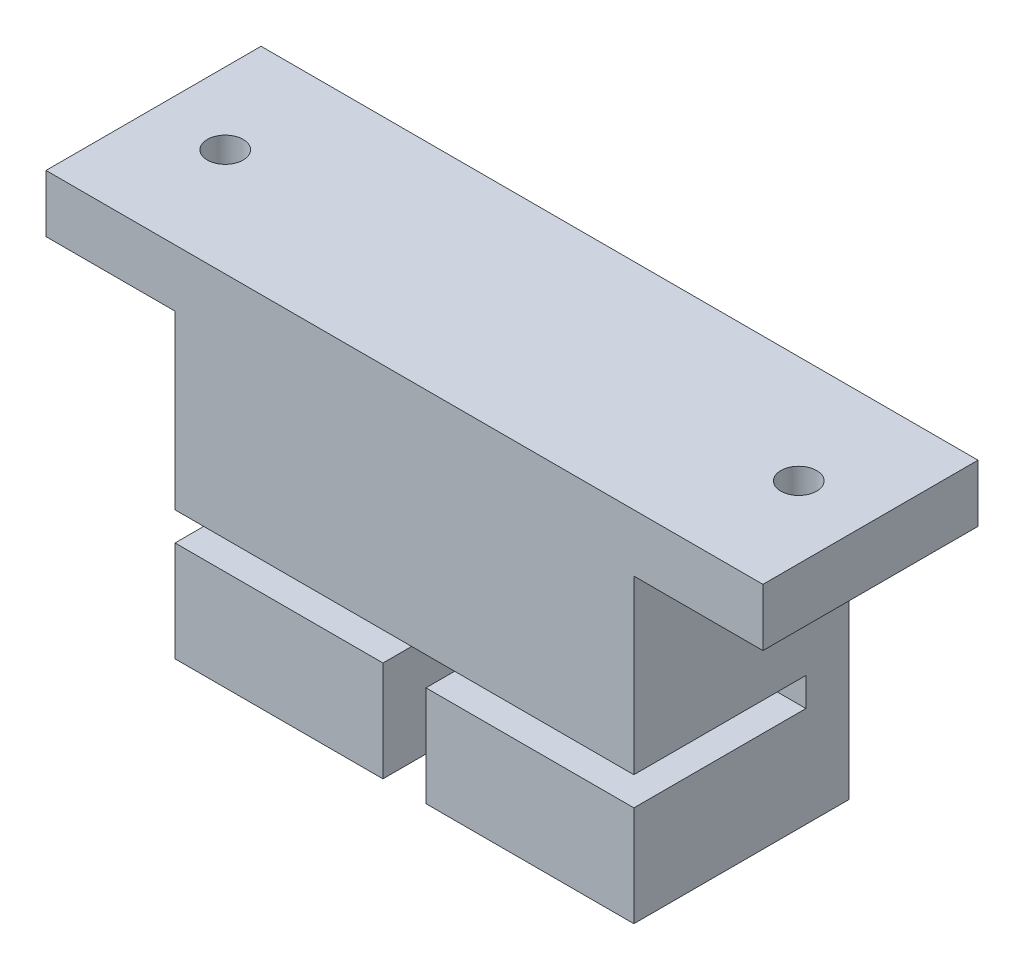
ISO-10303-21;
HEADER;
FILE_DESCRIPTION(('STEP AP214'),'2;1');
FILE_NAME('part.step','',(''),(''),'','','');
FILE_SCHEMA(('AUTOMOTIVE_DESIGN { 1 0 10303 214 1 1 1 1 }'));
ENDSEC;
DATA;
#1=APPLICATION_CONTEXT('core data for automotive mechanical design processes');
#2=APPLICATION_PROTOCOL_DEFINITION('international standard','automotive_design',2000,#1);
#3=PRODUCT_CONTEXT('',#1,'mechanical');
#4=PRODUCT('Part','Part','',(#3));
#5=PRODUCT_RELATED_PRODUCT_CATEGORY('part','',(#4));
#6=PRODUCT_DEFINITION_FORMATION('','',#4);
#7=PRODUCT_DEFINITION_CONTEXT('part definition',#1,'design');
#8=PRODUCT_DEFINITION('design','',#6,#7);
#9=PRODUCT_DEFINITION_SHAPE('','',#8);
#10=(LENGTH_UNIT() NAMED_UNIT(*) SI_UNIT(.MILLI.,.METRE.));
#11=(NAMED_UNIT(*) PLANE_ANGLE_UNIT() SI_UNIT($,.RADIAN.));
#12=(NAMED_UNIT(*) SI_UNIT($,.STERADIAN.) SOLID_ANGLE_UNIT());
#13=UNCERTAINTY_MEASURE_WITH_UNIT(LENGTH_MEASURE(1.E-05),#10,'distance_accuracy_value','');
#14=(GEOMETRIC_REPRESENTATION_CONTEXT(3) GLOBAL_UNCERTAINTY_ASSIGNED_CONTEXT((#13)) GLOBAL_UNIT_ASSIGNED_CONTEXT((#10,
#11,#12)) REPRESENTATION_CONTEXT('',''));
#15=CARTESIAN_POINT('',(0.,0.,0.));
#16=DIRECTION('',(0.,0.,1.));
#17=DIRECTION('',(1.,0.,0.));
#18=AXIS2_PLACEMENT_3D('',#15,#16,#17);
#19=CARTESIAN_POINT('',(0.,0.,15.));
#20=DIRECTION('',(0.,0.,1.));
#21=DIRECTION('',(1.,0.,0.));
#22=AXIS2_PLACEMENT_3D('',#19,#20,#21);
#23=PLANE('',#22);
#24=DIRECTION('',(0.,-1.,0.));
#25=VECTOR('',#24,1.);
#26=CARTESIAN_POINT('',(-1.5,-10.5,15.));
#27=LINE('',#26,#25);
#28=CARTESIAN_POINT('',(-1.5,-3.5,15.));
#29=VERTEX_POINT('',#28);
#30=CARTESIAN_POINT('',(-1.5,-10.5,15.));
#31=VERTEX_POINT('',#30);
#32=EDGE_CURVE('E250',#29,#31,#27,.T.);
#33=ORIENTED_EDGE('',*,*,#32,.F.);
#34=DIRECTION('',(1.,0.,0.));
#35=VECTOR('',#34,1.);
#36=CARTESIAN_POINT('',(-16.,-3.5,15.));
#37=LINE('',#36,#35);
#38=CARTESIAN_POINT('',(-16.,-3.5,15.));
#39=VERTEX_POINT('',#38);
#40=EDGE_CURVE('E238',#39,#29,#37,.T.);
#41=ORIENTED_EDGE('',*,*,#40,.F.);
#42=DIRECTION('',(0.,-1.,0.));
#43=VECTOR('',#42,1.);
#44=CARTESIAN_POINT('',(-16.,10.5,15.));
#45=LINE('',#44,#43);
#46=CARTESIAN_POINT('',(-16.,-10.5,15.));
#47=VERTEX_POINT('',#46);
#48=EDGE_CURVE('E140',#39,#47,#45,.T.);
#49=ORIENTED_EDGE('',*,*,#48,.T.);
#50=DIRECTION('',(1.,0.,0.));
#51=VECTOR('',#50,1.);
#52=CARTESIAN_POINT('',(-16.,-10.5,15.));
#53=LINE('',#52,#51);
#54=EDGE_CURVE('E159',#47,#31,#53,.T.);
#55=ORIENTED_EDGE('',*,*,#54,.T.);
#56=EDGE_LOOP('',(#33,#41,#49,#55));
#57=FACE_BOUND('',#56,.T.);
#58=ADVANCED_FACE('F44',(#57),#23,.T.);
#59=DIRECTION('',(-1.,0.,0.));
#60=VECTOR('',#59,1.);
#61=CARTESIAN_POINT('',(-16.,-1.5,15.));
#62=LINE('',#61,#60);
#63=CARTESIAN_POINT('',(16.,-1.5,15.));
#64=VERTEX_POINT('',#63);
#65=CARTESIAN_POINT('',(-16.,-1.5,15.));
#66=VERTEX_POINT('',#65);
#67=EDGE_CURVE('E242',#64,#66,#62,.T.);
#68=ORIENTED_EDGE('',*,*,#67,.F.);
#69=DIRECTION('',(0.,1.,0.));
#70=VECTOR('',#69,1.);
#71=CARTESIAN_POINT('',(16.,10.5,15.));
#72=LINE('',#71,#70);
#73=CARTESIAN_POINT('',(16.,10.5,15.));
#74=VERTEX_POINT('',#73);
#75=EDGE_CURVE('E111',#64,#74,#72,.T.);
#76=ORIENTED_EDGE('',*,*,#75,.T.);
#77=DIRECTION('',(1.,0.,0.));
#78=VECTOR('',#77,1.);
#79=CARTESIAN_POINT('',(16.,10.5,15.));
#80=LINE('',#79,#78);
#81=CARTESIAN_POINT('',(25.,10.5,15.));
#82=VERTEX_POINT('',#81);
#83=EDGE_CURVE('E214',#74,#82,#80,.T.);
#84=ORIENTED_EDGE('',*,*,#83,.T.);
#85=DIRECTION('',(0.,1.,0.));
#86=VECTOR('',#85,1.);
#87=CARTESIAN_POINT('',(25.,10.5,15.));
#88=LINE('',#87,#86);
#89=CARTESIAN_POINT('',(25.,14.5,15.));
#90=VERTEX_POINT('',#89);
#91=EDGE_CURVE('E197',#82,#90,#88,.T.);
#92=ORIENTED_EDGE('',*,*,#91,.T.);
#93=DIRECTION('',(-1.,0.,0.));
#94=VECTOR('',#93,1.);
#95=CARTESIAN_POINT('',(-25.,14.5,15.));
#96=LINE('',#95,#94);
#97=CARTESIAN_POINT('',(-25.,14.5,15.));
#98=VERTEX_POINT('',#97);
#99=EDGE_CURVE('E210',#90,#98,#96,.T.);
#100=ORIENTED_EDGE('',*,*,#99,.T.);
#101=DIRECTION('',(0.,-1.,0.));
#102=VECTOR('',#101,1.);
#103=CARTESIAN_POINT('',(-25.,10.5,15.));
#104=LINE('',#103,#102);
#105=CARTESIAN_POINT('',(-25.,10.5,15.));
#106=VERTEX_POINT('',#105);
#107=EDGE_CURVE('E136',#98,#106,#104,.T.);
#108=ORIENTED_EDGE('',*,*,#107,.T.);
#109=DIRECTION('',(1.,0.,0.));
#110=VECTOR('',#109,1.);
#111=CARTESIAN_POINT('',(-25.,10.5,15.));
#112=LINE('',#111,#110);
#113=CARTESIAN_POINT('',(-16.,10.5,15.));
#114=VERTEX_POINT('',#113);
#115=EDGE_CURVE('E129',#106,#114,#112,.T.);
#116=ORIENTED_EDGE('',*,*,#115,.T.);
#117=EDGE_CURVE('E134',#114,#66,#45,.T.);
#118=ORIENTED_EDGE('',*,*,#117,.T.);
#119=EDGE_LOOP('',(#68,#76,#84,#92,#100,#108,#116,#118));
#120=FACE_BOUND('',#119,.T.);
#121=ADVANCED_FACE('F131',(#120),#23,.T.);
#122=CARTESIAN_POINT('',(16.,10.5,15.));
#123=DIRECTION('',(-1.,0.,0.));
#124=DIRECTION('',(0.,0.,1.));
#125=AXIS2_PLACEMENT_3D('',#122,#123,#124);
#126=PLANE('',#125);
#127=ORIENTED_EDGE('',*,*,#75,.F.);
#128=DIRECTION('',(0.,0.,1.));
#129=VECTOR('',#128,1.);
#130=CARTESIAN_POINT('',(16.,-1.5,3.));
#131=LINE('',#130,#129);
#132=CARTESIAN_POINT('',(16.,-1.5,3.));
#133=VERTEX_POINT('',#132);
#134=EDGE_CURVE('E229',#133,#64,#131,.T.);
#135=ORIENTED_EDGE('',*,*,#134,.F.);
#136=DIRECTION('',(0.,1.,0.));
#137=VECTOR('',#136,1.);
#138=CARTESIAN_POINT('',(16.,-1.5,3.));
#139=LINE('',#138,#137);
#140=CARTESIAN_POINT('',(16.,-3.5,3.));
#141=VERTEX_POINT('',#140);
#142=EDGE_CURVE('E262',#141,#133,#139,.T.);
#143=ORIENTED_EDGE('',*,*,#142,.F.);
#144=DIRECTION('',(0.,0.,1.));
#145=VECTOR('',#144,1.);
#146=CARTESIAN_POINT('',(16.,-3.5,3.));
#147=LINE('',#146,#145);
#148=CARTESIAN_POINT('',(16.,-3.5,15.));
#149=VERTEX_POINT('',#148);
#150=EDGE_CURVE('E226',#141,#149,#147,.T.);
#151=ORIENTED_EDGE('',*,*,#150,.T.);
#152=CARTESIAN_POINT('',(16.,-10.5,15.));
#153=VERTEX_POINT('',#152);
#154=EDGE_CURVE('E216',#153,#149,#72,.T.);
#155=ORIENTED_EDGE('',*,*,#154,.F.);
#156=DIRECTION('',(0.,0.,-1.));
#157=VECTOR('',#156,1.);
#158=CARTESIAN_POINT('',(16.,-10.5,15.));
#159=LINE('',#158,#157);
#160=CARTESIAN_POINT('',(16.,-10.5,0.));
#161=VERTEX_POINT('',#160);
#162=EDGE_CURVE('E164',#153,#161,#159,.T.);
#163=ORIENTED_EDGE('',*,*,#162,.T.);
#164=DIRECTION('',(0.,1.,0.));
#165=VECTOR('',#164,1.);
#166=CARTESIAN_POINT('',(16.,10.5,0.));
#167=LINE('',#166,#165);
#168=CARTESIAN_POINT('',(16.,10.5,0.));
#169=VERTEX_POINT('',#168);
#170=EDGE_CURVE('E165',#161,#169,#167,.T.);
#171=ORIENTED_EDGE('',*,*,#170,.T.);
#172=DIRECTION('',(0.,0.,-1.));
#173=VECTOR('',#172,1.);
#174=CARTESIAN_POINT('',(16.,10.5,15.));
#175=LINE('',#174,#173);
#176=EDGE_CURVE('E13',#74,#169,#175,.T.);
#177=ORIENTED_EDGE('',*,*,#176,.F.);
#178=EDGE_LOOP('',(#127,#135,#143,#151,#155,#163,#171,#177));
#179=FACE_BOUND('',#178,.T.);
#180=ADVANCED_FACE('F46',(#179),#126,.F.);
#181=CARTESIAN_POINT('',(16.,10.5,15.));
#182=DIRECTION('',(0.,1.,0.));
#183=DIRECTION('',(0.,0.,1.));
#184=AXIS2_PLACEMENT_3D('',#181,#182,#183);
#185=PLANE('',#184);
#186=CARTESIAN_POINT('',(20.,10.5,7.49999999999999));
#187=DIRECTION('',(0.,1.,0.));
#188=DIRECTION('',(0.,0.,1.));
#189=AXIS2_PLACEMENT_3D('',#186,#187,#188);
#190=CIRCLE('',#189,1.25);
#191=CARTESIAN_POINT('',(20.,10.5,8.75));
#192=VERTEX_POINT('',#191);
#193=EDGE_CURVE('E253',#192,#192,#190,.T.);
#194=ORIENTED_EDGE('',*,*,#193,.T.);
#195=EDGE_LOOP('',(#194));
#196=FACE_BOUND('',#195,.T.);
#197=DIRECTION('',(1.,0.,0.));
#198=VECTOR('',#197,1.);
#199=CARTESIAN_POINT('',(16.,10.5,0.));
#200=LINE('',#199,#198);
#201=CARTESIAN_POINT('',(25.,10.5,0.));
#202=VERTEX_POINT('',#201);
#203=EDGE_CURVE('E168',#169,#202,#200,.T.);
#204=ORIENTED_EDGE('',*,*,#203,.T.);
#205=DIRECTION('',(0.,0.,-1.));
#206=VECTOR('',#205,1.);
#207=CARTESIAN_POINT('',(25.,10.5,15.));
#208=LINE('',#207,#206);
#209=EDGE_CURVE('E53',#82,#202,#208,.T.);
#210=ORIENTED_EDGE('',*,*,#209,.F.);
#211=ORIENTED_EDGE('',*,*,#83,.F.);
#212=ORIENTED_EDGE('',*,*,#176,.T.);
#213=EDGE_LOOP('',(#204,#210,#211,#212));
#214=FACE_BOUND('',#213,.T.);
#215=ADVANCED_FACE('F385',(#196,#214),#185,.F.);
#216=CARTESIAN_POINT('',(25.,10.5,15.));
#217=DIRECTION('',(-1.,0.,0.));
#218=DIRECTION('',(0.,0.,1.));
#219=AXIS2_PLACEMENT_3D('',#216,#217,#218);
#220=PLANE('',#219);
#221=DIRECTION('',(0.,1.,0.));
#222=VECTOR('',#221,1.);
#223=CARTESIAN_POINT('',(25.,10.5,0.));
#224=LINE('',#223,#222);
#225=CARTESIAN_POINT('',(25.,14.5,0.));
#226=VERTEX_POINT('',#225);
#227=EDGE_CURVE('E171',#202,#226,#224,.T.);
#228=ORIENTED_EDGE('',*,*,#227,.T.);
#229=DIRECTION('',(0.,0.,-1.));
#230=VECTOR('',#229,1.);
#231=CARTESIAN_POINT('',(25.,14.5,15.));
#232=LINE('',#231,#230);
#233=EDGE_CURVE('E187',#90,#226,#232,.T.);
#234=ORIENTED_EDGE('',*,*,#233,.F.);
#235=ORIENTED_EDGE('',*,*,#91,.F.);
#236=ORIENTED_EDGE('',*,*,#209,.T.);
#237=EDGE_LOOP('',(#228,#234,#235,#236));
#238=FACE_BOUND('',#237,.T.);
#239=ADVANCED_FACE('F195',(#238),#220,.F.);
#240=CARTESIAN_POINT('',(-25.,14.5,15.));
#241=DIRECTION('',(0.,-1.,0.));
#242=DIRECTION('',(0.,0.,-1.));
#243=AXIS2_PLACEMENT_3D('',#240,#241,#242);
#244=PLANE('',#243);
#245=CARTESIAN_POINT('',(-20.,14.5,7.5));
#246=DIRECTION('',(0.,1.,0.));
#247=DIRECTION('',(0.,0.,1.));
#248=AXIS2_PLACEMENT_3D('',#245,#246,#247);
#249=CIRCLE('',#248,1.25);
#250=CARTESIAN_POINT('',(-20.,14.5,8.75));
#251=VERTEX_POINT('',#250);
#252=EDGE_CURVE('E281',#251,#251,#249,.T.);
#253=ORIENTED_EDGE('',*,*,#252,.F.);
#254=EDGE_LOOP('',(#253));
#255=FACE_BOUND('',#254,.T.);
#256=CARTESIAN_POINT('',(20.,14.5,7.49999999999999));
#257=DIRECTION('',(0.,1.,0.));
#258=DIRECTION('',(0.,0.,1.));
#259=AXIS2_PLACEMENT_3D('',#256,#257,#258);
#260=CIRCLE('',#259,1.25);
#261=CARTESIAN_POINT('',(20.,14.5,8.75));
#262=VERTEX_POINT('',#261);
#263=EDGE_CURVE('E278',#262,#262,#260,.T.);
#264=ORIENTED_EDGE('',*,*,#263,.F.);
#265=EDGE_LOOP('',(#264));
#266=FACE_BOUND('',#265,.T.);
#267=DIRECTION('',(-1.,0.,0.));
#268=VECTOR('',#267,1.);
#269=CARTESIAN_POINT('',(-25.,14.5,0.));
#270=LINE('',#269,#268);
#271=CARTESIAN_POINT('',(-25.,14.5,0.));
#272=VERTEX_POINT('',#271);
#273=EDGE_CURVE('E173',#226,#272,#270,.T.);
#274=ORIENTED_EDGE('',*,*,#273,.T.);
#275=DIRECTION('',(0.,0.,-1.));
#276=VECTOR('',#275,1.);
#277=CARTESIAN_POINT('',(-25.,14.5,15.));
#278=LINE('',#277,#276);
#279=EDGE_CURVE('E184',#98,#272,#278,.T.);
#280=ORIENTED_EDGE('',*,*,#279,.F.);
#281=ORIENTED_EDGE('',*,*,#99,.F.);
#282=ORIENTED_EDGE('',*,*,#233,.T.);
#283=EDGE_LOOP('',(#274,#280,#281,#282));
#284=FACE_BOUND('',#283,.T.);
#285=ADVANCED_FACE('F206',(#255,#266,#284),#244,.F.);
#286=CARTESIAN_POINT('',(-25.,10.5,15.));
#287=DIRECTION('',(1.,0.,0.));
#288=DIRECTION('',(0.,0.,-1.));
#289=AXIS2_PLACEMENT_3D('',#286,#287,#288);
#290=PLANE('',#289);
#291=DIRECTION('',(0.,-1.,0.));
#292=VECTOR('',#291,1.);
#293=CARTESIAN_POINT('',(-25.,10.5,0.));
#294=LINE('',#293,#292);
#295=CARTESIAN_POINT('',(-25.,10.5,0.));
#296=VERTEX_POINT('',#295);
#297=EDGE_CURVE('E175',#272,#296,#294,.T.);
#298=ORIENTED_EDGE('',*,*,#297,.T.);
#299=DIRECTION('',(0.,0.,-1.));
#300=VECTOR('',#299,1.);
#301=CARTESIAN_POINT('',(-25.,10.5,15.));
#302=LINE('',#301,#300);
#303=EDGE_CURVE('E149',#106,#296,#302,.T.);
#304=ORIENTED_EDGE('',*,*,#303,.F.);
#305=ORIENTED_EDGE('',*,*,#107,.F.);
#306=ORIENTED_EDGE('',*,*,#279,.T.);
#307=EDGE_LOOP('',(#298,#304,#305,#306));
#308=FACE_BOUND('',#307,.T.);
#309=ADVANCED_FACE('F209',(#308),#290,.F.);
#310=CARTESIAN_POINT('',(-25.,10.5,15.));
#311=DIRECTION('',(0.,1.,0.));
#312=DIRECTION('',(0.,0.,1.));
#313=AXIS2_PLACEMENT_3D('',#310,#311,#312);
#314=PLANE('',#313);
#315=CARTESIAN_POINT('',(-20.,10.5,7.5));
#316=DIRECTION('',(0.,1.,0.));
#317=DIRECTION('',(0.,0.,1.));
#318=AXIS2_PLACEMENT_3D('',#315,#316,#317);
#319=CIRCLE('',#318,1.25);
#320=CARTESIAN_POINT('',(-20.,10.5,8.75));
#321=VERTEX_POINT('',#320);
#322=EDGE_CURVE('E48',#321,#321,#319,.T.);
#323=ORIENTED_EDGE('',*,*,#322,.T.);
#324=EDGE_LOOP('',(#323));
#325=FACE_BOUND('',#324,.T.);
#326=DIRECTION('',(1.,0.,0.));
#327=VECTOR('',#326,1.);
#328=CARTESIAN_POINT('',(-25.,10.5,0.));
#329=LINE('',#328,#327);
#330=CARTESIAN_POINT('',(-16.,10.5,0.));
#331=VERTEX_POINT('',#330);
#332=EDGE_CURVE('E146',#296,#331,#329,.T.);
#333=ORIENTED_EDGE('',*,*,#332,.T.);
#334=DIRECTION('',(0.,0.,-1.));
#335=VECTOR('',#334,1.);
#336=CARTESIAN_POINT('',(-16.,10.5,15.));
#337=LINE('',#336,#335);
#338=EDGE_CURVE('E143',#114,#331,#337,.T.);
#339=ORIENTED_EDGE('',*,*,#338,.F.);
#340=ORIENTED_EDGE('',*,*,#115,.F.);
#341=ORIENTED_EDGE('',*,*,#303,.T.);
#342=EDGE_LOOP('',(#333,#339,#340,#341));
#343=FACE_BOUND('',#342,.T.);
#344=ADVANCED_FACE('F144',(#325,#343),#314,.F.);
#345=CARTESIAN_POINT('',(-16.,10.5,15.));
#346=DIRECTION('',(1.,0.,0.));
#347=DIRECTION('',(0.,0.,-1.));
#348=AXIS2_PLACEMENT_3D('',#345,#346,#347);
#349=PLANE('',#348);
#350=ORIENTED_EDGE('',*,*,#48,.F.);
#351=DIRECTION('',(0.,0.,1.));
#352=VECTOR('',#351,1.);
#353=CARTESIAN_POINT('',(-16.,-3.5,3.));
#354=LINE('',#353,#352);
#355=CARTESIAN_POINT('',(-16.,-3.5,3.));
#356=VERTEX_POINT('',#355);
#357=EDGE_CURVE('E233',#356,#39,#354,.T.);
#358=ORIENTED_EDGE('',*,*,#357,.F.);
#359=DIRECTION('',(0.,-1.,0.));
#360=VECTOR('',#359,1.);
#361=CARTESIAN_POINT('',(-16.,-1.5,3.));
#362=LINE('',#361,#360);
#363=CARTESIAN_POINT('',(-16.,-1.5,3.));
#364=VERTEX_POINT('',#363);
#365=EDGE_CURVE('E256',#364,#356,#362,.T.);
#366=ORIENTED_EDGE('',*,*,#365,.F.);
#367=DIRECTION('',(0.,0.,1.));
#368=VECTOR('',#367,1.);
#369=CARTESIAN_POINT('',(-16.,-1.5,3.));
#370=LINE('',#369,#368);
#371=EDGE_CURVE('E157',#364,#66,#370,.T.);
#372=ORIENTED_EDGE('',*,*,#371,.T.);
#373=ORIENTED_EDGE('',*,*,#117,.F.);
#374=ORIENTED_EDGE('',*,*,#338,.T.);
#375=DIRECTION('',(0.,-1.,0.));
#376=VECTOR('',#375,1.);
#377=CARTESIAN_POINT('',(-16.,10.5,0.));
#378=LINE('',#377,#376);
#379=CARTESIAN_POINT('',(-16.,-10.5,0.));
#380=VERTEX_POINT('',#379);
#381=EDGE_CURVE('E178',#331,#380,#378,.T.);
#382=ORIENTED_EDGE('',*,*,#381,.T.);
#383=DIRECTION('',(0.,0.,-1.));
#384=VECTOR('',#383,1.);
#385=CARTESIAN_POINT('',(-16.,-10.5,15.));
#386=LINE('',#385,#384);
#387=EDGE_CURVE('E150',#47,#380,#386,.T.);
#388=ORIENTED_EDGE('',*,*,#387,.F.);
#389=EDGE_LOOP('',(#350,#358,#366,#372,#373,#374,#382,#388));
#390=FACE_BOUND('',#389,.T.);
#391=ADVANCED_FACE('F154',(#390),#349,.F.);
#392=CARTESIAN_POINT('',(-16.,-10.5,15.));
#393=DIRECTION('',(0.,1.,0.));
#394=DIRECTION('',(0.,0.,1.));
#395=AXIS2_PLACEMENT_3D('',#392,#393,#394);
#396=PLANE('',#395);
#397=DIRECTION('',(1.,0.,0.));
#398=VECTOR('',#397,1.);
#399=CARTESIAN_POINT('',(-1.5,-10.5,3.));
#400=LINE('',#399,#398);
#401=CARTESIAN_POINT('',(-1.5,-10.5,3.));
#402=VERTEX_POINT('',#401);
#403=CARTESIAN_POINT('',(1.5,-10.5,3.));
#404=VERTEX_POINT('',#403);
#405=EDGE_CURVE('E271',#402,#404,#400,.T.);
#406=ORIENTED_EDGE('',*,*,#405,.F.);
#407=DIRECTION('',(0.,0.,1.));
#408=VECTOR('',#407,1.);
#409=CARTESIAN_POINT('',(-1.5,-10.5,3.));
#410=LINE('',#409,#408);
#411=EDGE_CURVE('E218',#402,#31,#410,.T.);
#412=ORIENTED_EDGE('',*,*,#411,.T.);
#413=ORIENTED_EDGE('',*,*,#54,.F.);
#414=ORIENTED_EDGE('',*,*,#387,.T.);
#415=DIRECTION('',(1.,0.,0.));
#416=VECTOR('',#415,1.);
#417=CARTESIAN_POINT('',(-16.,-10.5,0.));
#418=LINE('',#417,#416);
#419=EDGE_CURVE('E102',#380,#161,#418,.T.);
#420=ORIENTED_EDGE('',*,*,#419,.T.);
#421=ORIENTED_EDGE('',*,*,#162,.F.);
#422=CARTESIAN_POINT('',(1.5,-10.5,15.));
#423=VERTEX_POINT('',#422);
#424=EDGE_CURVE('E68',#423,#153,#53,.T.);
#425=ORIENTED_EDGE('',*,*,#424,.F.);
#426=DIRECTION('',(0.,0.,1.));
#427=VECTOR('',#426,1.);
#428=CARTESIAN_POINT('',(1.5,-10.5,3.));
#429=LINE('',#428,#427);
#430=EDGE_CURVE('E60',#404,#423,#429,.T.);
#431=ORIENTED_EDGE('',*,*,#430,.F.);
#432=EDGE_LOOP('',(#406,#412,#413,#414,#420,#421,#425,#431));
#433=FACE_BOUND('',#432,.T.);
#434=ADVANCED_FACE('F314',(#433),#396,.F.);
#435=DIRECTION('',(1.,0.,0.));
#436=VECTOR('',#435,1.);
#437=CARTESIAN_POINT('',(1.5,-3.5,15.));
#438=LINE('',#437,#436);
#439=CARTESIAN_POINT('',(1.5,-3.5,15.));
#440=VERTEX_POINT('',#439);
#441=EDGE_CURVE('E245',#440,#149,#438,.T.);
#442=ORIENTED_EDGE('',*,*,#441,.F.);
#443=DIRECTION('',(0.,1.,0.));
#444=VECTOR('',#443,1.);
#445=CARTESIAN_POINT('',(1.5,-10.5,15.));
#446=LINE('',#445,#444);
#447=EDGE_CURVE('E248',#423,#440,#446,.T.);
#448=ORIENTED_EDGE('',*,*,#447,.F.);
#449=ORIENTED_EDGE('',*,*,#424,.T.);
#450=ORIENTED_EDGE('',*,*,#154,.T.);
#451=EDGE_LOOP('',(#442,#448,#449,#450));
#452=FACE_BOUND('',#451,.T.);
#453=ADVANCED_FACE('F306',(#452),#23,.T.);
#454=CARTESIAN_POINT('',(0.,0.,0.));
#455=DIRECTION('',(0.,0.,1.));
#456=DIRECTION('',(1.,0.,0.));
#457=AXIS2_PLACEMENT_3D('',#454,#455,#456);
#458=PLANE('',#457);
#459=ORIENTED_EDGE('',*,*,#170,.F.);
#460=ORIENTED_EDGE('',*,*,#419,.F.);
#461=ORIENTED_EDGE('',*,*,#381,.F.);
#462=ORIENTED_EDGE('',*,*,#332,.F.);
#463=ORIENTED_EDGE('',*,*,#297,.F.);
#464=ORIENTED_EDGE('',*,*,#273,.F.);
#465=ORIENTED_EDGE('',*,*,#227,.F.);
#466=ORIENTED_EDGE('',*,*,#203,.F.);
#467=EDGE_LOOP('',(#459,#460,#461,#462,#463,#464,#465,#466));
#468=FACE_BOUND('',#467,.T.);
#469=ADVANCED_FACE('F202',(#468),#458,.F.);
#470=CARTESIAN_POINT('',(-1.5,-10.5,3.));
#471=DIRECTION('',(-1.,0.,0.));
#472=DIRECTION('',(0.,0.,1.));
#473=AXIS2_PLACEMENT_3D('',#470,#471,#472);
#474=PLANE('',#473);
#475=ORIENTED_EDGE('',*,*,#32,.T.);
#476=ORIENTED_EDGE('',*,*,#411,.F.);
#477=DIRECTION('',(0.,-1.,0.));
#478=VECTOR('',#477,1.);
#479=CARTESIAN_POINT('',(-1.5,-10.5,3.));
#480=LINE('',#479,#478);
#481=CARTESIAN_POINT('',(-1.5,-3.5,3.));
#482=VERTEX_POINT('',#481);
#483=EDGE_CURVE('E241',#482,#402,#480,.T.);
#484=ORIENTED_EDGE('',*,*,#483,.F.);
#485=DIRECTION('',(0.,0.,1.));
#486=VECTOR('',#485,1.);
#487=CARTESIAN_POINT('',(-1.5,-3.5,3.));
#488=LINE('',#487,#486);
#489=EDGE_CURVE('E169',#482,#29,#488,.T.);
#490=ORIENTED_EDGE('',*,*,#489,.T.);
#491=EDGE_LOOP('',(#475,#476,#484,#490));
#492=FACE_BOUND('',#491,.T.);
#493=ADVANCED_FACE('F319',(#492),#474,.F.);
#494=CARTESIAN_POINT('',(-16.,-3.5,3.));
#495=DIRECTION('',(0.,-1.,0.));
#496=DIRECTION('',(0.,0.,-1.));
#497=AXIS2_PLACEMENT_3D('',#494,#495,#496);
#498=PLANE('',#497);
#499=ORIENTED_EDGE('',*,*,#40,.T.);
#500=ORIENTED_EDGE('',*,*,#489,.F.);
#501=DIRECTION('',(1.,0.,0.));
#502=VECTOR('',#501,1.);
#503=CARTESIAN_POINT('',(-16.,-3.5,3.));
#504=LINE('',#503,#502);
#505=EDGE_CURVE('E221',#356,#482,#504,.T.);
#506=ORIENTED_EDGE('',*,*,#505,.F.);
#507=ORIENTED_EDGE('',*,*,#357,.T.);
#508=EDGE_LOOP('',(#499,#500,#506,#507));
#509=FACE_BOUND('',#508,.T.);
#510=ADVANCED_FACE('F370',(#509),#498,.F.);
#511=CARTESIAN_POINT('',(-16.,-1.5,3.));
#512=DIRECTION('',(0.,1.,0.));
#513=DIRECTION('',(-1.,0.,0.));
#514=AXIS2_PLACEMENT_3D('',#511,#512,#513);
#515=PLANE('',#514);
#516=ORIENTED_EDGE('',*,*,#67,.T.);
#517=ORIENTED_EDGE('',*,*,#371,.F.);
#518=DIRECTION('',(-1.,0.,0.));
#519=VECTOR('',#518,1.);
#520=CARTESIAN_POINT('',(-16.,-1.5,3.));
#521=LINE('',#520,#519);
#522=EDGE_CURVE('E259',#133,#364,#521,.T.);
#523=ORIENTED_EDGE('',*,*,#522,.F.);
#524=ORIENTED_EDGE('',*,*,#134,.T.);
#525=EDGE_LOOP('',(#516,#517,#523,#524));
#526=FACE_BOUND('',#525,.T.);
#527=ADVANCED_FACE('F375',(#526),#515,.F.);
#528=CARTESIAN_POINT('',(1.5,-3.5,3.));
#529=DIRECTION('',(0.,-1.,0.));
#530=DIRECTION('',(0.,0.,-1.));
#531=AXIS2_PLACEMENT_3D('',#528,#529,#530);
#532=PLANE('',#531);
#533=ORIENTED_EDGE('',*,*,#441,.T.);
#534=ORIENTED_EDGE('',*,*,#150,.F.);
#535=DIRECTION('',(1.,0.,0.));
#536=VECTOR('',#535,1.);
#537=CARTESIAN_POINT('',(1.5,-3.5,3.));
#538=LINE('',#537,#536);
#539=CARTESIAN_POINT('',(1.5,-3.5,3.));
#540=VERTEX_POINT('',#539);
#541=EDGE_CURVE('E265',#540,#141,#538,.T.);
#542=ORIENTED_EDGE('',*,*,#541,.F.);
#543=DIRECTION('',(0.,0.,1.));
#544=VECTOR('',#543,1.);
#545=CARTESIAN_POINT('',(1.5,-3.5,3.));
#546=LINE('',#545,#544);
#547=EDGE_CURVE('E223',#540,#440,#546,.T.);
#548=ORIENTED_EDGE('',*,*,#547,.T.);
#549=EDGE_LOOP('',(#533,#534,#542,#548));
#550=FACE_BOUND('',#549,.T.);
#551=ADVANCED_FACE('F329',(#550),#532,.F.);
#552=CARTESIAN_POINT('',(1.5,-10.5,3.));
#553=DIRECTION('',(1.,0.,0.));
#554=DIRECTION('',(0.,0.,-1.));
#555=AXIS2_PLACEMENT_3D('',#552,#553,#554);
#556=PLANE('',#555);
#557=ORIENTED_EDGE('',*,*,#447,.T.);
#558=ORIENTED_EDGE('',*,*,#547,.F.);
#559=DIRECTION('',(0.,1.,0.));
#560=VECTOR('',#559,1.);
#561=CARTESIAN_POINT('',(1.5,-10.5,3.));
#562=LINE('',#561,#560);
#563=EDGE_CURVE('E268',#404,#540,#562,.T.);
#564=ORIENTED_EDGE('',*,*,#563,.F.);
#565=ORIENTED_EDGE('',*,*,#430,.T.);
#566=EDGE_LOOP('',(#557,#558,#564,#565));
#567=FACE_BOUND('',#566,.T.);
#568=ADVANCED_FACE('F300',(#567),#556,.F.);
#569=CARTESIAN_POINT('',(0.,0.,3.));
#570=DIRECTION('',(0.,0.,-1.));
#571=DIRECTION('',(-1.,0.,0.));
#572=AXIS2_PLACEMENT_3D('',#569,#570,#571);
#573=PLANE('',#572);
#574=ORIENTED_EDGE('',*,*,#483,.T.);
#575=ORIENTED_EDGE('',*,*,#405,.T.);
#576=ORIENTED_EDGE('',*,*,#563,.T.);
#577=ORIENTED_EDGE('',*,*,#541,.T.);
#578=ORIENTED_EDGE('',*,*,#142,.T.);
#579=ORIENTED_EDGE('',*,*,#522,.T.);
#580=ORIENTED_EDGE('',*,*,#365,.T.);
#581=ORIENTED_EDGE('',*,*,#505,.T.);
#582=EDGE_LOOP('',(#574,#575,#576,#577,#578,#579,#580,#581));
#583=FACE_BOUND('',#582,.T.);
#584=ADVANCED_FACE('F292',(#583),#573,.F.);
#585=CARTESIAN_POINT('',(-20.,2.5,7.5));
#586=DIRECTION('',(0.,1.,0.));
#587=DIRECTION('',(0.,0.,1.));
#588=AXIS2_PLACEMENT_3D('',#585,#586,#587);
#589=CYLINDRICAL_SURFACE('',#588,1.25);
#590=ORIENTED_EDGE('',*,*,#252,.T.);
#591=EDGE_LOOP('',(#590));
#592=FACE_BOUND('',#591,.T.);
#593=ORIENTED_EDGE('',*,*,#322,.F.);
#594=EDGE_LOOP('',(#593));
#595=FACE_BOUND('',#594,.T.);
#596=ADVANCED_FACE('F289',(#592,#595),#589,.F.);
#597=CARTESIAN_POINT('',(20.,2.5,7.49999999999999));
#598=DIRECTION('',(0.,1.,0.));
#599=DIRECTION('',(0.,0.,1.));
#600=AXIS2_PLACEMENT_3D('',#597,#598,#599);
#601=CYLINDRICAL_SURFACE('',#600,1.25);
#602=ORIENTED_EDGE('',*,*,#263,.T.);
#603=EDGE_LOOP('',(#602));
#604=FACE_BOUND('',#603,.T.);
#605=ORIENTED_EDGE('',*,*,#193,.F.);
#606=EDGE_LOOP('',(#605));
#607=FACE_BOUND('',#606,.T.);
#608=ADVANCED_FACE('F291',(#604,#607),#601,.F.);
#609=CLOSED_SHELL('',(#58,#121,#180,#215,#239,#285,#309,#344,#391,#434,#453,#469,#493,#510,#527,
#551,#568,#584,#596,#608));
#610=MANIFOLD_SOLID_BREP('B2',#609);
#611=ADVANCED_BREP_SHAPE_REPRESENTATION('',(#18,#610),#14);
#612=SHAPE_DEFINITION_REPRESENTATION(#9,#611);
ENDSEC;
END-ISO-10303-21;
